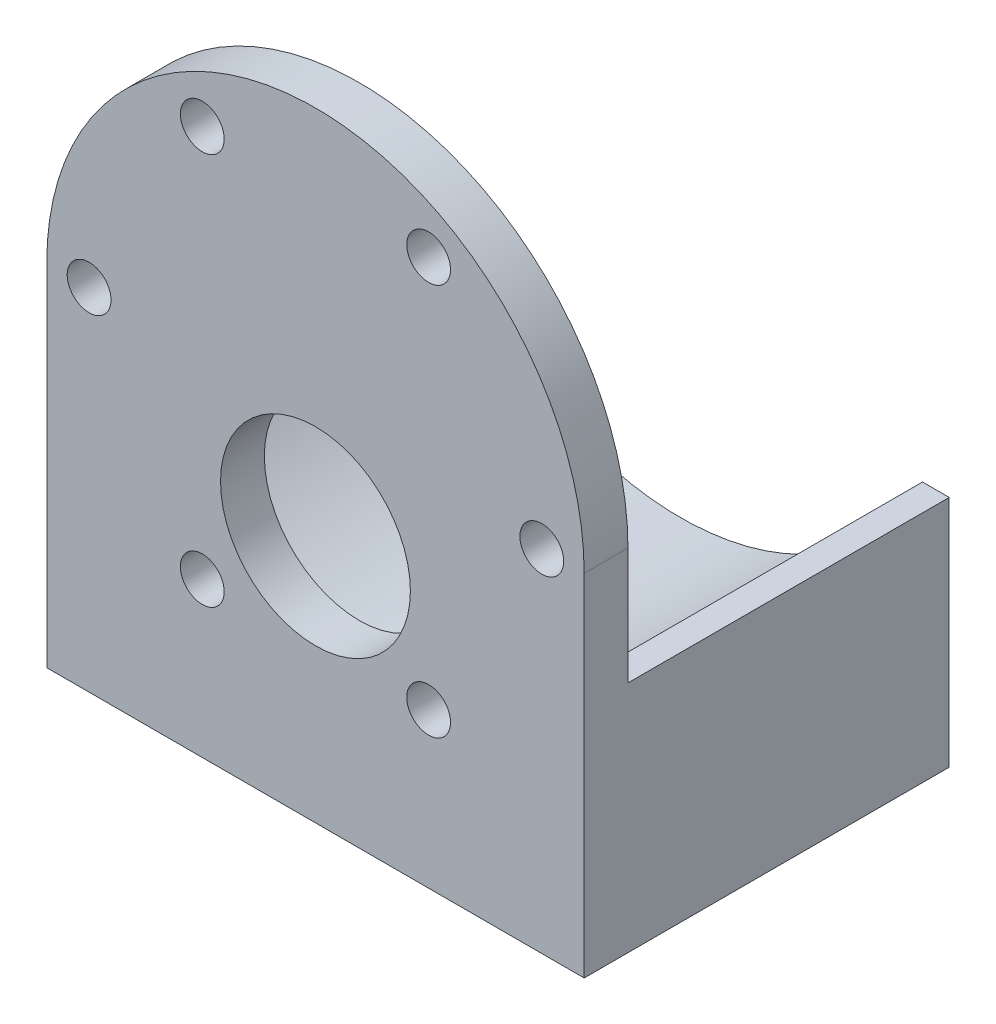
ISO-10303-21;
HEADER;
FILE_DESCRIPTION(('STEP AP214'),'2;1');
FILE_NAME('part.step','',(''),(''),'','','');
FILE_SCHEMA(('AUTOMOTIVE_DESIGN { 1 0 10303 214 1 1 1 1 }'));
ENDSEC;
DATA;
#1=APPLICATION_CONTEXT('core data for automotive mechanical design processes');
#2=APPLICATION_PROTOCOL_DEFINITION('international standard','automotive_design',2000,#1);
#3=PRODUCT_CONTEXT('',#1,'mechanical');
#4=PRODUCT('Part','Part','',(#3));
#5=PRODUCT_RELATED_PRODUCT_CATEGORY('part','',(#4));
#6=PRODUCT_DEFINITION_FORMATION('','',#4);
#7=PRODUCT_DEFINITION_CONTEXT('part definition',#1,'design');
#8=PRODUCT_DEFINITION('design','',#6,#7);
#9=PRODUCT_DEFINITION_SHAPE('','',#8);
#10=(LENGTH_UNIT() NAMED_UNIT(*) SI_UNIT(.MILLI.,.METRE.));
#11=(NAMED_UNIT(*) PLANE_ANGLE_UNIT() SI_UNIT($,.RADIAN.));
#12=(NAMED_UNIT(*) SI_UNIT($,.STERADIAN.) SOLID_ANGLE_UNIT());
#13=UNCERTAINTY_MEASURE_WITH_UNIT(LENGTH_MEASURE(1.E-05),#10,'distance_accuracy_value','');
#14=(GEOMETRIC_REPRESENTATION_CONTEXT(3) GLOBAL_UNCERTAINTY_ASSIGNED_CONTEXT((#13)) GLOBAL_UNIT_ASSIGNED_CONTEXT((#10,
#11,#12)) REPRESENTATION_CONTEXT('',''));
#15=CARTESIAN_POINT('',(0.,0.,0.));
#16=DIRECTION('',(0.,0.,1.));
#17=DIRECTION('',(1.,0.,0.));
#18=AXIS2_PLACEMENT_3D('',#15,#16,#17);
#19=CARTESIAN_POINT('',(0.,0.,3.));
#20=DIRECTION('',(0.,0.,1.));
#21=DIRECTION('',(1.,0.,0.));
#22=AXIS2_PLACEMENT_3D('',#19,#20,#21);
#23=PLANE('',#22);
#24=CARTESIAN_POINT('',(0.,-7.,3.));
#25=DIRECTION('',(0.,0.,1.));
#26=DIRECTION('',(1.,0.,0.));
#27=AXIS2_PLACEMENT_3D('',#24,#25,#26);
#28=CIRCLE('',#27,6.5);
#29=CARTESIAN_POINT('',(6.5,-7.,3.));
#30=VERTEX_POINT('',#29);
#31=EDGE_CURVE('E176',#30,#30,#28,.T.);
#32=ORIENTED_EDGE('',*,*,#31,.F.);
#33=EDGE_LOOP('',(#32));
#34=FACE_BOUND('',#33,.T.);
#35=CARTESIAN_POINT('',(-7.75,-13.4233937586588,3.));
#36=DIRECTION('',(0.,0.,1.));
#37=DIRECTION('',(1.,0.,0.));
#38=AXIS2_PLACEMENT_3D('',#35,#36,#37);
#39=CIRCLE('',#38,1.5);
#40=CARTESIAN_POINT('',(-6.25,-13.4233937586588,3.));
#41=VERTEX_POINT('',#40);
#42=EDGE_CURVE('E194',#41,#41,#39,.T.);
#43=ORIENTED_EDGE('',*,*,#42,.F.);
#44=EDGE_LOOP('',(#43));
#45=FACE_BOUND('',#44,.T.);
#46=CARTESIAN_POINT('',(-15.5,0.,3.));
#47=DIRECTION('',(0.,0.,1.));
#48=DIRECTION('',(1.,0.,0.));
#49=AXIS2_PLACEMENT_3D('',#46,#47,#48);
#50=CIRCLE('',#49,1.5);
#51=CARTESIAN_POINT('',(-14.,0.,3.));
#52=VERTEX_POINT('',#51);
#53=EDGE_CURVE('E210',#52,#52,#50,.T.);
#54=ORIENTED_EDGE('',*,*,#53,.F.);
#55=EDGE_LOOP('',(#54));
#56=FACE_BOUND('',#55,.T.);
#57=CARTESIAN_POINT('',(7.75,13.4233937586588,3.));
#58=DIRECTION('',(0.,0.,1.));
#59=DIRECTION('',(1.,0.,0.));
#60=AXIS2_PLACEMENT_3D('',#57,#58,#59);
#61=CIRCLE('',#60,1.5);
#62=CARTESIAN_POINT('',(9.25000000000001,13.4233937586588,3.));
#63=VERTEX_POINT('',#62);
#64=EDGE_CURVE('E226',#63,#63,#61,.T.);
#65=ORIENTED_EDGE('',*,*,#64,.F.);
#66=EDGE_LOOP('',(#65));
#67=FACE_BOUND('',#66,.T.);
#68=CARTESIAN_POINT('',(0.,0.,3.));
#69=DIRECTION('',(0.,0.,1.));
#70=DIRECTION('',(1.,0.,0.));
#71=AXIS2_PLACEMENT_3D('',#68,#69,#70);
#72=CIRCLE('',#71,18.4);
#73=CARTESIAN_POINT('',(18.4,0.,3.));
#74=VERTEX_POINT('',#73);
#75=CARTESIAN_POINT('',(-18.4,0.,3.));
#76=VERTEX_POINT('',#75);
#77=EDGE_CURVE('E234',#74,#76,#72,.T.);
#78=ORIENTED_EDGE('',*,*,#77,.T.);
#79=DIRECTION('',(0.,-1.,0.));
#80=VECTOR('',#79,1.);
#81=CARTESIAN_POINT('',(-18.4,0.,3.));
#82=LINE('',#81,#80);
#83=CARTESIAN_POINT('',(-18.4,-24.,3.));
#84=VERTEX_POINT('',#83);
#85=EDGE_CURVE('E168',#76,#84,#82,.T.);
#86=ORIENTED_EDGE('',*,*,#85,.T.);
#87=DIRECTION('',(1.,0.,0.));
#88=VECTOR('',#87,1.);
#89=CARTESIAN_POINT('',(-18.4,-24.,3.));
#90=LINE('',#89,#88);
#91=CARTESIAN_POINT('',(18.4,-24.,3.));
#92=VERTEX_POINT('',#91);
#93=EDGE_CURVE('E114',#84,#92,#90,.T.);
#94=ORIENTED_EDGE('',*,*,#93,.T.);
#95=DIRECTION('',(0.,1.,0.));
#96=VECTOR('',#95,1.);
#97=CARTESIAN_POINT('',(18.4,-24.,3.));
#98=LINE('',#97,#96);
#99=EDGE_CURVE('E61',#92,#74,#98,.T.);
#100=ORIENTED_EDGE('',*,*,#99,.T.);
#101=EDGE_LOOP('',(#78,#86,#94,#100));
#102=FACE_BOUND('',#101,.T.);
#103=CARTESIAN_POINT('',(-7.75,13.4233937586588,3.));
#104=DIRECTION('',(0.,0.,1.));
#105=DIRECTION('',(1.,0.,0.));
#106=AXIS2_PLACEMENT_3D('',#103,#104,#105);
#107=CIRCLE('',#106,1.5);
#108=CARTESIAN_POINT('',(-6.25,13.4233937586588,3.));
#109=VERTEX_POINT('',#108);
#110=EDGE_CURVE('E218',#109,#109,#107,.T.);
#111=ORIENTED_EDGE('',*,*,#110,.F.);
#112=EDGE_LOOP('',(#111));
#113=FACE_BOUND('',#112,.T.);
#114=CARTESIAN_POINT('',(15.5,0.,3.));
#115=DIRECTION('',(0.,0.,1.));
#116=DIRECTION('',(1.,0.,0.));
#117=AXIS2_PLACEMENT_3D('',#114,#115,#116);
#118=CIRCLE('',#117,1.5);
#119=CARTESIAN_POINT('',(17.,0.,3.));
#120=VERTEX_POINT('',#119);
#121=EDGE_CURVE('E202',#120,#120,#118,.T.);
#122=ORIENTED_EDGE('',*,*,#121,.F.);
#123=EDGE_LOOP('',(#122));
#124=FACE_BOUND('',#123,.T.);
#125=CARTESIAN_POINT('',(7.75,-13.4233937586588,3.));
#126=DIRECTION('',(0.,0.,1.));
#127=DIRECTION('',(1.,0.,0.));
#128=AXIS2_PLACEMENT_3D('',#125,#126,#127);
#129=CIRCLE('',#128,1.5);
#130=CARTESIAN_POINT('',(9.25000000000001,-13.4233937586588,3.));
#131=VERTEX_POINT('',#130);
#132=EDGE_CURVE('E186',#131,#131,#129,.T.);
#133=ORIENTED_EDGE('',*,*,#132,.F.);
#134=EDGE_LOOP('',(#133));
#135=FACE_BOUND('',#134,.T.);
#136=ADVANCED_FACE('F45',(#34,#45,#56,#67,#102,#113,#124,#135),#23,.T.);
#137=CARTESIAN_POINT('',(0.,0.,0.));
#138=DIRECTION('',(0.,0.,1.));
#139=DIRECTION('',(1.,0.,0.));
#140=AXIS2_PLACEMENT_3D('',#137,#138,#139);
#141=PLANE('',#140);
#142=CARTESIAN_POINT('',(15.5,0.,0.));
#143=DIRECTION('',(0.,0.,1.));
#144=DIRECTION('',(1.,0.,0.));
#145=AXIS2_PLACEMENT_3D('',#142,#143,#144);
#146=CIRCLE('',#145,1.5);
#147=CARTESIAN_POINT('',(17.,0.,0.));
#148=VERTEX_POINT('',#147);
#149=EDGE_CURVE('E198',#148,#148,#146,.T.);
#150=ORIENTED_EDGE('',*,*,#149,.T.);
#151=EDGE_LOOP('',(#150));
#152=FACE_BOUND('',#151,.T.);
#153=CARTESIAN_POINT('',(-15.5,0.,0.));
#154=DIRECTION('',(0.,0.,1.));
#155=DIRECTION('',(1.,0.,0.));
#156=AXIS2_PLACEMENT_3D('',#153,#154,#155);
#157=CIRCLE('',#156,1.5);
#158=CARTESIAN_POINT('',(-14.,0.,0.));
#159=VERTEX_POINT('',#158);
#160=EDGE_CURVE('E206',#159,#159,#157,.T.);
#161=ORIENTED_EDGE('',*,*,#160,.T.);
#162=EDGE_LOOP('',(#161));
#163=FACE_BOUND('',#162,.T.);
#164=CARTESIAN_POINT('',(0.,-7.,0.));
#165=DIRECTION('',(0.,0.,1.));
#166=DIRECTION('',(1.,0.,0.));
#167=AXIS2_PLACEMENT_3D('',#164,#165,#166);
#168=CIRCLE('',#167,6.5);
#169=CARTESIAN_POINT('',(6.5,-7.,0.));
#170=VERTEX_POINT('',#169);
#171=EDGE_CURVE('E178',#170,#170,#168,.T.);
#172=ORIENTED_EDGE('',*,*,#171,.T.);
#173=EDGE_LOOP('',(#172));
#174=FACE_BOUND('',#173,.T.);
#175=CARTESIAN_POINT('',(0.,0.,0.));
#176=DIRECTION('',(0.,0.,1.));
#177=DIRECTION('',(1.,0.,0.));
#178=AXIS2_PLACEMENT_3D('',#175,#176,#177);
#179=CIRCLE('',#178,18.4);
#180=CARTESIAN_POINT('',(-16.5698521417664,-7.99999999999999,0.));
#181=VERTEX_POINT('',#180);
#182=CARTESIAN_POINT('',(16.5698521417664,-8.,0.));
#183=VERTEX_POINT('',#182);
#184=EDGE_CURVE('E230',#181,#183,#179,.T.);
#185=ORIENTED_EDGE('',*,*,#184,.F.);
#186=DIRECTION('',(1.,0.,0.));
#187=VECTOR('',#186,1.);
#188=CARTESIAN_POINT('',(-43.6,-7.99999999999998,0.));
#189=LINE('',#188,#187);
#190=CARTESIAN_POINT('',(-18.4,-7.99999999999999,0.));
#191=VERTEX_POINT('',#190);
#192=EDGE_CURVE('E159',#191,#181,#189,.T.);
#193=ORIENTED_EDGE('',*,*,#192,.F.);
#194=DIRECTION('',(0.,1.,0.));
#195=VECTOR('',#194,1.);
#196=CARTESIAN_POINT('',(-18.4,0.,0.));
#197=LINE('',#196,#195);
#198=CARTESIAN_POINT('',(-18.4,0.,0.));
#199=VERTEX_POINT('',#198);
#200=EDGE_CURVE('E11',#191,#199,#197,.T.);
#201=ORIENTED_EDGE('',*,*,#200,.T.);
#202=CARTESIAN_POINT('',(18.4,0.,0.));
#203=VERTEX_POINT('',#202);
#204=EDGE_CURVE('E238',#203,#199,#179,.T.);
#205=ORIENTED_EDGE('',*,*,#204,.F.);
#206=DIRECTION('',(0.,-1.,0.));
#207=VECTOR('',#206,1.);
#208=CARTESIAN_POINT('',(18.4,0.,0.));
#209=LINE('',#208,#207);
#210=CARTESIAN_POINT('',(18.4,-8.00000000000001,0.));
#211=VERTEX_POINT('',#210);
#212=EDGE_CURVE('E149',#203,#211,#209,.T.);
#213=ORIENTED_EDGE('',*,*,#212,.T.);
#214=EDGE_CURVE('E156',#183,#211,#189,.T.);
#215=ORIENTED_EDGE('',*,*,#214,.F.);
#216=EDGE_LOOP('',(#185,#193,#201,#205,#213,#215));
#217=FACE_BOUND('',#216,.T.);
#218=CARTESIAN_POINT('',(-7.75,-13.4233937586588,0.));
#219=DIRECTION('',(0.,0.,1.));
#220=DIRECTION('',(1.,0.,0.));
#221=AXIS2_PLACEMENT_3D('',#218,#219,#220);
#222=CIRCLE('',#221,1.5);
#223=CARTESIAN_POINT('',(-6.25,-13.4233937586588,0.));
#224=VERTEX_POINT('',#223);
#225=EDGE_CURVE('E190',#224,#224,#222,.T.);
#226=ORIENTED_EDGE('',*,*,#225,.T.);
#227=EDGE_LOOP('',(#226));
#228=FACE_BOUND('',#227,.T.);
#229=CARTESIAN_POINT('',(7.75,-13.4233937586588,0.));
#230=DIRECTION('',(0.,0.,1.));
#231=DIRECTION('',(1.,0.,0.));
#232=AXIS2_PLACEMENT_3D('',#229,#230,#231);
#233=CIRCLE('',#232,1.5);
#234=CARTESIAN_POINT('',(9.25000000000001,-13.4233937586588,0.));
#235=VERTEX_POINT('',#234);
#236=EDGE_CURVE('E182',#235,#235,#233,.T.);
#237=ORIENTED_EDGE('',*,*,#236,.T.);
#238=EDGE_LOOP('',(#237));
#239=FACE_BOUND('',#238,.T.);
#240=CARTESIAN_POINT('',(-7.75,13.4233937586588,0.));
#241=DIRECTION('',(0.,0.,1.));
#242=DIRECTION('',(1.,0.,0.));
#243=AXIS2_PLACEMENT_3D('',#240,#241,#242);
#244=CIRCLE('',#243,1.5);
#245=CARTESIAN_POINT('',(-6.25,13.4233937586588,0.));
#246=VERTEX_POINT('',#245);
#247=EDGE_CURVE('E214',#246,#246,#244,.T.);
#248=ORIENTED_EDGE('',*,*,#247,.T.);
#249=EDGE_LOOP('',(#248));
#250=FACE_BOUND('',#249,.T.);
#251=CARTESIAN_POINT('',(7.75,13.4233937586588,0.));
#252=DIRECTION('',(0.,0.,1.));
#253=DIRECTION('',(1.,0.,0.));
#254=AXIS2_PLACEMENT_3D('',#251,#252,#253);
#255=CIRCLE('',#254,1.5);
#256=CARTESIAN_POINT('',(9.25000000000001,13.4233937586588,0.));
#257=VERTEX_POINT('',#256);
#258=EDGE_CURVE('E222',#257,#257,#255,.T.);
#259=ORIENTED_EDGE('',*,*,#258,.T.);
#260=EDGE_LOOP('',(#259));
#261=FACE_BOUND('',#260,.T.);
#262=ADVANCED_FACE('F253',(#152,#163,#174,#217,#228,#239,#250,#261),#141,.F.);
#263=CARTESIAN_POINT('',(0.,0.,3.));
#264=DIRECTION('',(0.,0.,-1.));
#265=DIRECTION('',(-1.,0.,0.));
#266=AXIS2_PLACEMENT_3D('',#263,#264,#265);
#267=CYLINDRICAL_SURFACE('',#266,18.4);
#268=ORIENTED_EDGE('',*,*,#77,.F.);
#269=DIRECTION('',(0.,0.,-1.));
#270=VECTOR('',#269,1.);
#271=CARTESIAN_POINT('',(18.4,0.,3.));
#272=LINE('',#271,#270);
#273=EDGE_CURVE('E54',#74,#203,#272,.T.);
#274=ORIENTED_EDGE('',*,*,#273,.T.);
#275=ORIENTED_EDGE('',*,*,#204,.T.);
#276=DIRECTION('',(0.,0.,-1.));
#277=VECTOR('',#276,1.);
#278=CARTESIAN_POINT('',(-18.4,0.,3.));
#279=LINE('',#278,#277);
#280=EDGE_CURVE('E237',#76,#199,#279,.T.);
#281=ORIENTED_EDGE('',*,*,#280,.F.);
#282=EDGE_LOOP('',(#268,#274,#275,#281));
#283=FACE_BOUND('',#282,.T.);
#284=ADVANCED_FACE('F47',(#283),#267,.T.);
#285=CARTESIAN_POINT('',(7.75,13.4233937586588,3.));
#286=DIRECTION('',(0.,0.,-1.));
#287=DIRECTION('',(-1.,0.,0.));
#288=AXIS2_PLACEMENT_3D('',#285,#286,#287);
#289=CYLINDRICAL_SURFACE('',#288,1.5);
#290=ORIENTED_EDGE('',*,*,#64,.T.);
#291=EDGE_LOOP('',(#290));
#292=FACE_BOUND('',#291,.T.);
#293=ORIENTED_EDGE('',*,*,#258,.F.);
#294=EDGE_LOOP('',(#293));
#295=FACE_BOUND('',#294,.T.);
#296=ADVANCED_FACE('F291',(#292,#295),#289,.F.);
#297=CARTESIAN_POINT('',(-7.75,13.4233937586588,3.));
#298=DIRECTION('',(0.,0.,-1.));
#299=DIRECTION('',(-1.,0.,0.));
#300=AXIS2_PLACEMENT_3D('',#297,#298,#299);
#301=CYLINDRICAL_SURFACE('',#300,1.5);
#302=ORIENTED_EDGE('',*,*,#110,.T.);
#303=EDGE_LOOP('',(#302));
#304=FACE_BOUND('',#303,.T.);
#305=ORIENTED_EDGE('',*,*,#247,.F.);
#306=EDGE_LOOP('',(#305));
#307=FACE_BOUND('',#306,.T.);
#308=ADVANCED_FACE('F294',(#304,#307),#301,.F.);
#309=CARTESIAN_POINT('',(-15.5,0.,3.));
#310=DIRECTION('',(0.,0.,-1.));
#311=DIRECTION('',(-1.,0.,0.));
#312=AXIS2_PLACEMENT_3D('',#309,#310,#311);
#313=CYLINDRICAL_SURFACE('',#312,1.5);
#314=ORIENTED_EDGE('',*,*,#53,.T.);
#315=EDGE_LOOP('',(#314));
#316=FACE_BOUND('',#315,.T.);
#317=ORIENTED_EDGE('',*,*,#160,.F.);
#318=EDGE_LOOP('',(#317));
#319=FACE_BOUND('',#318,.T.);
#320=ADVANCED_FACE('F298',(#316,#319),#313,.F.);
#321=CARTESIAN_POINT('',(15.5,0.,3.));
#322=DIRECTION('',(0.,0.,-1.));
#323=DIRECTION('',(-1.,0.,0.));
#324=AXIS2_PLACEMENT_3D('',#321,#322,#323);
#325=CYLINDRICAL_SURFACE('',#324,1.5);
#326=ORIENTED_EDGE('',*,*,#121,.T.);
#327=EDGE_LOOP('',(#326));
#328=FACE_BOUND('',#327,.T.);
#329=ORIENTED_EDGE('',*,*,#149,.F.);
#330=EDGE_LOOP('',(#329));
#331=FACE_BOUND('',#330,.T.);
#332=ADVANCED_FACE('F302',(#328,#331),#325,.F.);
#333=CARTESIAN_POINT('',(-7.75,-13.4233937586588,3.));
#334=DIRECTION('',(0.,0.,-1.));
#335=DIRECTION('',(-1.,0.,0.));
#336=AXIS2_PLACEMENT_3D('',#333,#334,#335);
#337=CYLINDRICAL_SURFACE('',#336,1.5);
#338=ORIENTED_EDGE('',*,*,#42,.T.);
#339=EDGE_LOOP('',(#338));
#340=FACE_BOUND('',#339,.T.);
#341=ORIENTED_EDGE('',*,*,#225,.F.);
#342=EDGE_LOOP('',(#341));
#343=FACE_BOUND('',#342,.T.);
#344=ADVANCED_FACE('F306',(#340,#343),#337,.F.);
#345=CARTESIAN_POINT('',(7.75,-13.4233937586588,3.));
#346=DIRECTION('',(0.,0.,-1.));
#347=DIRECTION('',(-1.,0.,0.));
#348=AXIS2_PLACEMENT_3D('',#345,#346,#347);
#349=CYLINDRICAL_SURFACE('',#348,1.5);
#350=ORIENTED_EDGE('',*,*,#132,.T.);
#351=EDGE_LOOP('',(#350));
#352=FACE_BOUND('',#351,.T.);
#353=ORIENTED_EDGE('',*,*,#236,.F.);
#354=EDGE_LOOP('',(#353));
#355=FACE_BOUND('',#354,.T.);
#356=ADVANCED_FACE('F310',(#352,#355),#349,.F.);
#357=CARTESIAN_POINT('',(0.,-7.,0.));
#358=DIRECTION('',(0.,0.,1.));
#359=DIRECTION('',(1.,0.,0.));
#360=AXIS2_PLACEMENT_3D('',#357,#358,#359);
#361=CYLINDRICAL_SURFACE('',#360,6.5);
#362=ORIENTED_EDGE('',*,*,#171,.F.);
#363=EDGE_LOOP('',(#362));
#364=FACE_BOUND('',#363,.T.);
#365=ORIENTED_EDGE('',*,*,#31,.T.);
#366=EDGE_LOOP('',(#365));
#367=FACE_BOUND('',#366,.T.);
#368=ADVANCED_FACE('F313',(#364,#367),#361,.F.);
#369=CARTESIAN_POINT('',(0.,0.,-2.));
#370=DIRECTION('',(0.,0.,1.));
#371=DIRECTION('',(1.,0.,0.));
#372=AXIS2_PLACEMENT_3D('',#369,#370,#371);
#373=CYLINDRICAL_SURFACE('',#372,18.4);
#374=DIRECTION('',(0.,0.,1.));
#375=VECTOR('',#374,1.);
#376=CARTESIAN_POINT('',(16.5698521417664,-8.,-2.));
#377=LINE('',#376,#375);
#378=CARTESIAN_POINT('',(16.5698521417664,-8.,-22.));
#379=VERTEX_POINT('',#378);
#380=EDGE_CURVE('E165',#379,#183,#377,.T.);
#381=ORIENTED_EDGE('',*,*,#380,.F.);
#382=CARTESIAN_POINT('',(0.,0.,-22.));
#383=DIRECTION('',(0.,0.,1.));
#384=DIRECTION('',(-1.,0.,0.));
#385=AXIS2_PLACEMENT_3D('',#382,#383,#384);
#386=CIRCLE('',#385,18.4);
#387=CARTESIAN_POINT('',(-16.5698521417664,-8.,-22.));
#388=VERTEX_POINT('',#387);
#389=EDGE_CURVE('E140',#388,#379,#386,.T.);
#390=ORIENTED_EDGE('',*,*,#389,.F.);
#391=DIRECTION('',(0.,0.,1.));
#392=VECTOR('',#391,1.);
#393=CARTESIAN_POINT('',(-16.5698521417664,-7.99999999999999,-2.));
#394=LINE('',#393,#392);
#395=EDGE_CURVE('E162',#181,#388,#394,.F.);
#396=ORIENTED_EDGE('',*,*,#395,.F.);
#397=ORIENTED_EDGE('',*,*,#184,.T.);
#398=EDGE_LOOP('',(#381,#390,#396,#397));
#399=FACE_BOUND('',#398,.T.);
#400=ADVANCED_FACE('F266',(#399),#373,.F.);
#401=CARTESIAN_POINT('',(18.4,-24.,-2.));
#402=DIRECTION('',(1.,0.,0.));
#403=DIRECTION('',(0.,1.,0.));
#404=AXIS2_PLACEMENT_3D('',#401,#402,#403);
#405=PLANE('',#404);
#406=ORIENTED_EDGE('',*,*,#212,.F.);
#407=ORIENTED_EDGE('',*,*,#273,.F.);
#408=ORIENTED_EDGE('',*,*,#99,.F.);
#409=DIRECTION('',(0.,0.,1.));
#410=VECTOR('',#409,1.);
#411=CARTESIAN_POINT('',(18.4,-24.,-2.));
#412=LINE('',#411,#410);
#413=CARTESIAN_POINT('',(18.4,-24.,-22.));
#414=VERTEX_POINT('',#413);
#415=EDGE_CURVE('E69',#414,#92,#412,.T.);
#416=ORIENTED_EDGE('',*,*,#415,.F.);
#417=DIRECTION('',(0.,-1.,0.));
#418=VECTOR('',#417,1.);
#419=CARTESIAN_POINT('',(18.4,-24.,-22.));
#420=LINE('',#419,#418);
#421=CARTESIAN_POINT('',(18.4,-8.00000000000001,-22.));
#422=VERTEX_POINT('',#421);
#423=EDGE_CURVE('E134',#422,#414,#420,.T.);
#424=ORIENTED_EDGE('',*,*,#423,.F.);
#425=DIRECTION('',(0.,0.,-1.));
#426=VECTOR('',#425,1.);
#427=CARTESIAN_POINT('',(18.4,-8.00000000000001,0.));
#428=LINE('',#427,#426);
#429=EDGE_CURVE('E153',#211,#422,#428,.T.);
#430=ORIENTED_EDGE('',*,*,#429,.F.);
#431=EDGE_LOOP('',(#406,#407,#408,#416,#424,#430));
#432=FACE_BOUND('',#431,.T.);
#433=ADVANCED_FACE('F259',(#432),#405,.T.);
#434=CARTESIAN_POINT('',(-18.4,-24.,-2.));
#435=DIRECTION('',(0.,-1.,0.));
#436=DIRECTION('',(0.,0.,-1.));
#437=AXIS2_PLACEMENT_3D('',#434,#435,#436);
#438=PLANE('',#437);
#439=ORIENTED_EDGE('',*,*,#93,.F.);
#440=DIRECTION('',(0.,0.,1.));
#441=VECTOR('',#440,1.);
#442=CARTESIAN_POINT('',(-18.4,-24.,-2.));
#443=LINE('',#442,#441);
#444=CARTESIAN_POINT('',(-18.4,-24.,-22.));
#445=VERTEX_POINT('',#444);
#446=EDGE_CURVE('E109',#445,#84,#443,.T.);
#447=ORIENTED_EDGE('',*,*,#446,.F.);
#448=DIRECTION('',(-1.,0.,0.));
#449=VECTOR('',#448,1.);
#450=CARTESIAN_POINT('',(-18.4,-24.,-22.));
#451=LINE('',#450,#449);
#452=EDGE_CURVE('E113',#414,#445,#451,.T.);
#453=ORIENTED_EDGE('',*,*,#452,.F.);
#454=ORIENTED_EDGE('',*,*,#415,.T.);
#455=EDGE_LOOP('',(#439,#447,#453,#454));
#456=FACE_BOUND('',#455,.T.);
#457=ADVANCED_FACE('F111',(#456),#438,.T.);
#458=CARTESIAN_POINT('',(-18.4,0.,-2.));
#459=DIRECTION('',(-1.,0.,0.));
#460=DIRECTION('',(0.,-1.,0.));
#461=AXIS2_PLACEMENT_3D('',#458,#459,#460);
#462=PLANE('',#461);
#463=ORIENTED_EDGE('',*,*,#200,.F.);
#464=DIRECTION('',(0.,0.,1.));
#465=VECTOR('',#464,1.);
#466=CARTESIAN_POINT('',(-18.4,-7.99999999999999,-2.));
#467=LINE('',#466,#465);
#468=CARTESIAN_POINT('',(-18.4,-7.99999999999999,-22.));
#469=VERTEX_POINT('',#468);
#470=EDGE_CURVE('E123',#469,#191,#467,.T.);
#471=ORIENTED_EDGE('',*,*,#470,.F.);
#472=DIRECTION('',(0.,1.,0.));
#473=VECTOR('',#472,1.);
#474=CARTESIAN_POINT('',(-18.4,-7.99999999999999,-22.));
#475=LINE('',#474,#473);
#476=EDGE_CURVE('E120',#445,#469,#475,.T.);
#477=ORIENTED_EDGE('',*,*,#476,.F.);
#478=ORIENTED_EDGE('',*,*,#446,.T.);
#479=ORIENTED_EDGE('',*,*,#85,.F.);
#480=ORIENTED_EDGE('',*,*,#280,.T.);
#481=EDGE_LOOP('',(#463,#471,#477,#478,#479,#480));
#482=FACE_BOUND('',#481,.T.);
#483=ADVANCED_FACE('F122',(#482),#462,.T.);
#484=CARTESIAN_POINT('',(-43.6,-7.99999999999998,0.));
#485=DIRECTION('',(0.,-1.,0.));
#486=DIRECTION('',(1.,0.,0.));
#487=AXIS2_PLACEMENT_3D('',#484,#485,#486);
#488=PLANE('',#487);
#489=ORIENTED_EDGE('',*,*,#380,.T.);
#490=ORIENTED_EDGE('',*,*,#214,.T.);
#491=ORIENTED_EDGE('',*,*,#429,.T.);
#492=DIRECTION('',(1.,0.,0.));
#493=VECTOR('',#492,1.);
#494=CARTESIAN_POINT('',(18.4,-8.00000000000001,-22.));
#495=LINE('',#494,#493);
#496=EDGE_CURVE('E144',#379,#422,#495,.T.);
#497=ORIENTED_EDGE('',*,*,#496,.F.);
#498=EDGE_LOOP('',(#489,#490,#491,#497));
#499=FACE_BOUND('',#498,.T.);
#500=ADVANCED_FACE('F262',(#499),#488,.F.);
#501=ORIENTED_EDGE('',*,*,#395,.T.);
#502=DIRECTION('',(1.,0.,0.));
#503=VECTOR('',#502,1.);
#504=CARTESIAN_POINT('',(-16.5698521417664,-7.99999999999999,-22.));
#505=LINE('',#504,#503);
#506=EDGE_CURVE('E128',#469,#388,#505,.T.);
#507=ORIENTED_EDGE('',*,*,#506,.F.);
#508=ORIENTED_EDGE('',*,*,#470,.T.);
#509=ORIENTED_EDGE('',*,*,#192,.T.);
#510=EDGE_LOOP('',(#501,#507,#508,#509));
#511=FACE_BOUND('',#510,.T.);
#512=ADVANCED_FACE('F271',(#511),#488,.F.);
#513=CARTESIAN_POINT('',(0.,0.,-22.));
#514=DIRECTION('',(0.,0.,-1.));
#515=DIRECTION('',(-1.,0.,0.));
#516=AXIS2_PLACEMENT_3D('',#513,#514,#515);
#517=PLANE('',#516);
#518=ORIENTED_EDGE('',*,*,#452,.T.);
#519=ORIENTED_EDGE('',*,*,#476,.T.);
#520=ORIENTED_EDGE('',*,*,#506,.T.);
#521=ORIENTED_EDGE('',*,*,#389,.T.);
#522=ORIENTED_EDGE('',*,*,#496,.T.);
#523=ORIENTED_EDGE('',*,*,#423,.T.);
#524=EDGE_LOOP('',(#518,#519,#520,#521,#522,#523));
#525=FACE_BOUND('',#524,.T.);
#526=ADVANCED_FACE('F131',(#525),#517,.T.);
#527=CLOSED_SHELL('',(#136,#262,#284,#296,#308,#320,#332,#344,#356,#368,#400,#433,#457,#483,
#500,#512,#526));
#528=MANIFOLD_SOLID_BREP('B2',#527);
#529=ADVANCED_BREP_SHAPE_REPRESENTATION('',(#18,#528),#14);
#530=SHAPE_DEFINITION_REPRESENTATION(#9,#529);
ENDSEC;
END-ISO-10303-21;
